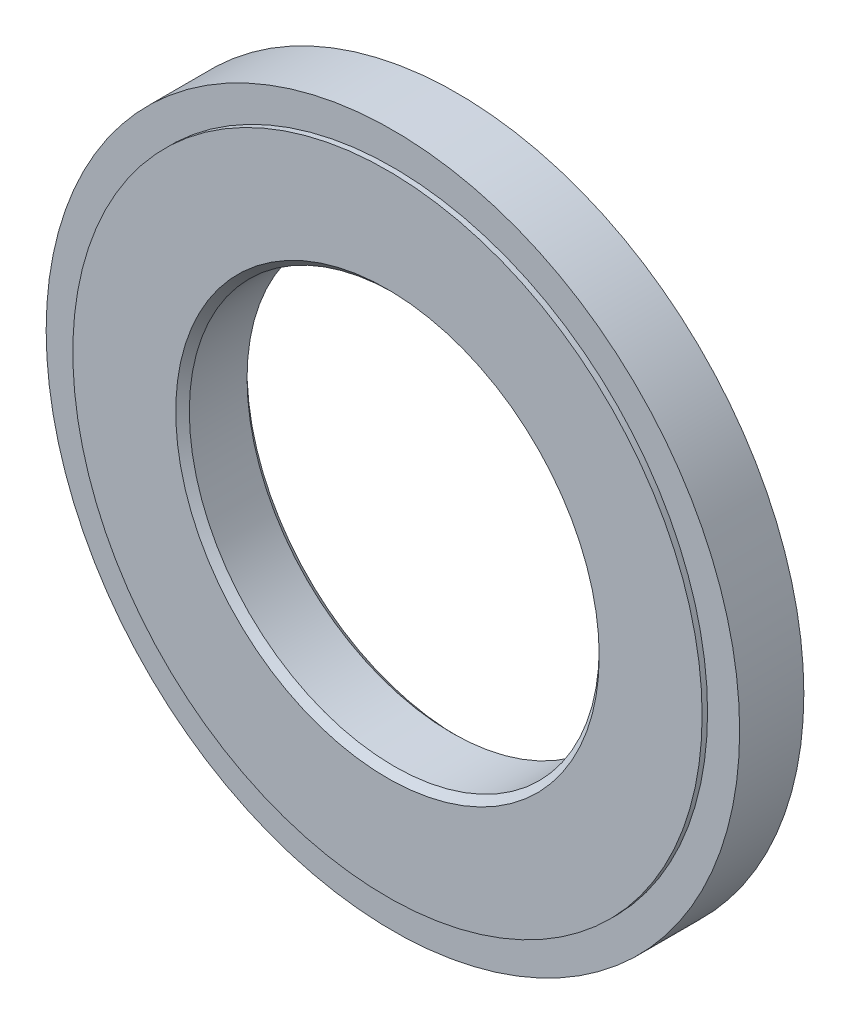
ISO-10303-21;
HEADER;
FILE_DESCRIPTION(('STEP AP214'),'2;1');
FILE_NAME('part.step','',(''),(''),'','','');
FILE_SCHEMA(('AUTOMOTIVE_DESIGN { 1 0 10303 214 1 1 1 1 }'));
ENDSEC;
DATA;
#1=APPLICATION_CONTEXT('core data for automotive mechanical design processes');
#2=APPLICATION_PROTOCOL_DEFINITION('international standard','automotive_design',2000,#1);
#3=PRODUCT_CONTEXT('',#1,'mechanical');
#4=PRODUCT('Part','Part','',(#3));
#5=PRODUCT_RELATED_PRODUCT_CATEGORY('part','',(#4));
#6=PRODUCT_DEFINITION_FORMATION('','',#4);
#7=PRODUCT_DEFINITION_CONTEXT('part definition',#1,'design');
#8=PRODUCT_DEFINITION('design','',#6,#7);
#9=PRODUCT_DEFINITION_SHAPE('','',#8);
#10=(LENGTH_UNIT() NAMED_UNIT(*) SI_UNIT(.MILLI.,.METRE.));
#11=(NAMED_UNIT(*) PLANE_ANGLE_UNIT() SI_UNIT($,.RADIAN.));
#12=(NAMED_UNIT(*) SI_UNIT($,.STERADIAN.) SOLID_ANGLE_UNIT());
#13=UNCERTAINTY_MEASURE_WITH_UNIT(LENGTH_MEASURE(1.E-05),#10,'distance_accuracy_value','');
#14=(GEOMETRIC_REPRESENTATION_CONTEXT(3) GLOBAL_UNCERTAINTY_ASSIGNED_CONTEXT((#13)) GLOBAL_UNIT_ASSIGNED_CONTEXT((#10,
#11,#12)) REPRESENTATION_CONTEXT('',''));
#15=CARTESIAN_POINT('',(0.,0.,0.));
#16=DIRECTION('',(0.,0.,1.));
#17=DIRECTION('',(1.,0.,0.));
#18=AXIS2_PLACEMENT_3D('',#15,#16,#17);
#19=CARTESIAN_POINT('',(0.,0.,10.5));
#20=DIRECTION('',(0.,0.,-1.));
#21=DIRECTION('',(-1.,0.,0.));
#22=AXIS2_PLACEMENT_3D('',#19,#20,#21);
#23=CYLINDRICAL_SURFACE('',#22,102.1);
#24=CARTESIAN_POINT('',(0.,0.,8.9));
#25=DIRECTION('',(0.,0.,1.));
#26=DIRECTION('',(1.,0.,0.));
#27=AXIS2_PLACEMENT_3D('',#24,#25,#26);
#28=CIRCLE('',#27,102.1);
#29=CARTESIAN_POINT('',(-102.1,0.,8.9));
#30=VERTEX_POINT('',#29);
#31=EDGE_CURVE('E112',#30,#30,#28,.T.);
#32=CARTESIAN_POINT('',(0.,0.,-10.));
#33=DIRECTION('',(0.,0.,-1.));
#34=DIRECTION('',(-1.,0.,0.));
#35=AXIS2_PLACEMENT_3D('',#32,#33,#34);
#36=CIRCLE('',#35,102.1);
#37=CARTESIAN_POINT('',(-102.1,0.,-10.));
#38=VERTEX_POINT('',#37);
#39=EDGE_CURVE('E103',#38,#38,#36,.F.);
#40=CARTESIAN_POINT('',(-102.1,0.,8.9));
#41=CARTESIAN_POINT('',(-102.1,0.,8.703125));
#42=CARTESIAN_POINT('',(-102.1,0.,8.50625));
#43=CARTESIAN_POINT('',(-102.1,0.,8.1125));
#44=CARTESIAN_POINT('',(-102.1,0.,7.915625));
#45=CARTESIAN_POINT('',(-102.1,0.,7.521875));
#46=CARTESIAN_POINT('',(-102.1,0.,7.325));
#47=CARTESIAN_POINT('',(-102.1,0.,6.93125));
#48=CARTESIAN_POINT('',(-102.1,0.,6.734375));
#49=CARTESIAN_POINT('',(-102.1,0.,6.340625));
#50=CARTESIAN_POINT('',(-102.1,0.,6.14375));
#51=CARTESIAN_POINT('',(-102.1,0.,5.75));
#52=CARTESIAN_POINT('',(-102.1,0.,5.553125));
#53=CARTESIAN_POINT('',(-102.1,0.,5.159375));
#54=CARTESIAN_POINT('',(-102.1,0.,4.9625));
#55=CARTESIAN_POINT('',(-102.1,0.,4.56875));
#56=CARTESIAN_POINT('',(-102.1,0.,4.371875));
#57=CARTESIAN_POINT('',(-102.1,0.,3.978125));
#58=CARTESIAN_POINT('',(-102.1,0.,3.78125));
#59=CARTESIAN_POINT('',(-102.1,0.,3.3875));
#60=CARTESIAN_POINT('',(-102.1,0.,3.190625));
#61=CARTESIAN_POINT('',(-102.1,0.,2.796875));
#62=CARTESIAN_POINT('',(-102.1,0.,2.6));
#63=CARTESIAN_POINT('',(-102.1,0.,2.20625));
#64=CARTESIAN_POINT('',(-102.1,0.,2.009375));
#65=CARTESIAN_POINT('',(-102.1,0.,1.615625));
#66=CARTESIAN_POINT('',(-102.1,0.,1.41875));
#67=CARTESIAN_POINT('',(-102.1,0.,1.025));
#68=CARTESIAN_POINT('',(-102.1,0.,0.828125));
#69=CARTESIAN_POINT('',(-102.1,0.,0.434375));
#70=CARTESIAN_POINT('',(-102.1,0.,0.237499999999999));
#71=CARTESIAN_POINT('',(-102.1,0.,-0.156250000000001));
#72=CARTESIAN_POINT('',(-102.1,0.,-0.353125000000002));
#73=CARTESIAN_POINT('',(-102.1,0.,-0.746875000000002));
#74=CARTESIAN_POINT('',(-102.1,0.,-0.943750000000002));
#75=CARTESIAN_POINT('',(-102.1,0.,-1.3375));
#76=CARTESIAN_POINT('',(-102.1,0.,-1.534375));
#77=CARTESIAN_POINT('',(-102.1,0.,-1.928125));
#78=CARTESIAN_POINT('',(-102.1,0.,-2.125));
#79=CARTESIAN_POINT('',(-102.1,0.,-2.51875));
#80=CARTESIAN_POINT('',(-102.1,0.,-2.715625));
#81=CARTESIAN_POINT('',(-102.1,0.,-3.109375));
#82=CARTESIAN_POINT('',(-102.1,0.,-3.30625));
#83=CARTESIAN_POINT('',(-102.1,0.,-3.7));
#84=CARTESIAN_POINT('',(-102.1,0.,-3.896875));
#85=CARTESIAN_POINT('',(-102.1,0.,-4.290625));
#86=CARTESIAN_POINT('',(-102.1,0.,-4.4875));
#87=CARTESIAN_POINT('',(-102.1,0.,-4.88125));
#88=CARTESIAN_POINT('',(-102.1,0.,-5.078125));
#89=CARTESIAN_POINT('',(-102.1,0.,-5.471875));
#90=CARTESIAN_POINT('',(-102.1,0.,-5.66875));
#91=CARTESIAN_POINT('',(-102.1,0.,-6.0625));
#92=CARTESIAN_POINT('',(-102.1,0.,-6.259375));
#93=CARTESIAN_POINT('',(-102.1,0.,-6.653125));
#94=CARTESIAN_POINT('',(-102.1,0.,-6.85));
#95=CARTESIAN_POINT('',(-102.1,0.,-7.24375));
#96=CARTESIAN_POINT('',(-102.1,0.,-7.440625));
#97=CARTESIAN_POINT('',(-102.1,0.,-7.834375));
#98=CARTESIAN_POINT('',(-102.1,0.,-8.03125));
#99=CARTESIAN_POINT('',(-102.1,0.,-8.425));
#100=CARTESIAN_POINT('',(-102.1,0.,-8.621875));
#101=CARTESIAN_POINT('',(-102.1,0.,-9.015625));
#102=CARTESIAN_POINT('',(-102.1,0.,-9.2125));
#103=CARTESIAN_POINT('',(-102.1,0.,-9.60625));
#104=CARTESIAN_POINT('',(-102.1,0.,-9.803125));
#105=CARTESIAN_POINT('',(-102.1,0.,-10.));
#106=B_SPLINE_CURVE_WITH_KNOTS('',3,(#40,#41,#42,#43,#44,#45,#46,#47,#48,#49,#50,#51,#52,#53,
#54,#55,#56,#57,#58,#59,#60,#61,#62,#63,#64,#65,#66,#67,#68,#69,#70,#71,#72,#73,#74,#75,#76,#77,
#78,#79,#80,#81,#82,#83,#84,#85,#86,#87,#88,#89,#90,#91,#92,#93,#94,#95,#96,#97,#98,#99,#100,
#101,#102,#103,#104,#105),.UNSPECIFIED.,.F.,.F.,(4,2,2,2,2,2,2,2,2,2,2,2,2,2,2,2,2,2,2,2,2,2,2,
2,2,2,2,2,2,2,2,2,4),(0.,0.590625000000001,1.18125,1.771875,2.3625,2.953125,3.54375,4.134375,
4.725,5.315625,5.90625,6.496875,7.0875,7.678125,8.26875,8.859375,9.45,10.040625,10.63125,
11.221875,11.8125,12.403125,12.99375,13.584375,14.175,14.765625,15.35625,15.946875,16.5375,
17.128125,17.71875,18.309375,18.9),.UNSPECIFIED.);
#107=EDGE_CURVE('BSEAM33',#30,#38,#106,.T.);
#108=ORIENTED_EDGE('',*,*,#31,.F.);
#109=ORIENTED_EDGE('',*,*,#39,.T.);
#110=ORIENTED_EDGE('',*,*,#107,.T.);
#111=ORIENTED_EDGE('',*,*,#107,.F.);
#112=EDGE_LOOP('',(#108,#110,#109,#111));
#113=FACE_BOUND('',#112,.T.);
#114=ADVANCED_FACE('F33',(#113),#23,.T.);
#115=CARTESIAN_POINT('',(0.,0.,8.9));
#116=DIRECTION('',(0.,0.,1.));
#117=DIRECTION('',(1.,0.,0.));
#118=AXIS2_PLACEMENT_3D('',#115,#116,#117);
#119=CYLINDRICAL_SURFACE('',#118,92.65);
#120=CARTESIAN_POINT('',(0.,0.,8.9));
#121=DIRECTION('',(0.,0.,1.));
#122=DIRECTION('',(1.,0.,0.));
#123=AXIS2_PLACEMENT_3D('',#120,#121,#122);
#124=CIRCLE('',#123,92.65);
#125=CARTESIAN_POINT('',(92.65,0.,8.9));
#126=VERTEX_POINT('',#125);
#127=EDGE_CURVE('E109',#126,#126,#124,.T.);
#128=ORIENTED_EDGE('',*,*,#127,.T.);
#129=EDGE_LOOP('',(#128));
#130=FACE_BOUND('',#129,.T.);
#131=CARTESIAN_POINT('',(0.,0.,10.5));
#132=DIRECTION('',(0.,0.,1.));
#133=DIRECTION('',(1.,0.,0.));
#134=AXIS2_PLACEMENT_3D('',#131,#132,#133);
#135=CIRCLE('',#134,92.65);
#136=CARTESIAN_POINT('',(92.65,0.,10.5));
#137=VERTEX_POINT('',#136);
#138=EDGE_CURVE('E106',#137,#137,#135,.T.);
#139=ORIENTED_EDGE('',*,*,#138,.F.);
#140=EDGE_LOOP('',(#139));
#141=FACE_BOUND('',#140,.T.);
#142=ADVANCED_FACE('F156',(#130,#141),#119,.T.);
#143=CARTESIAN_POINT('',(0.,-224.761421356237,8.9));
#144=DIRECTION('',(0.,0.,1.));
#145=DIRECTION('',(1.,0.,0.));
#146=AXIS2_PLACEMENT_3D('',#143,#144,#145);
#147=PLANE('',#146);
#148=ORIENTED_EDGE('',*,*,#127,.F.);
#149=EDGE_LOOP('',(#148));
#150=FACE_BOUND('',#149,.T.);
#151=ORIENTED_EDGE('',*,*,#31,.T.);
#152=EDGE_LOOP('',(#151));
#153=FACE_BOUND('',#152,.T.);
#154=ADVANCED_FACE('F152',(#150,#153),#147,.T.);
#155=CARTESIAN_POINT('',(0.,0.,10.5));
#156=DIRECTION('',(0.,0.,1.));
#157=DIRECTION('',(1.,0.,0.));
#158=AXIS2_PLACEMENT_3D('',#155,#156,#157);
#159=PLANE('',#158);
#160=CARTESIAN_POINT('',(0.,0.,10.5));
#161=DIRECTION('',(0.,0.,1.));
#162=DIRECTION('',(1.,0.,0.));
#163=AXIS2_PLACEMENT_3D('',#160,#161,#162);
#164=CIRCLE('',#163,62.3500000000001);
#165=CARTESIAN_POINT('',(62.3500000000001,0.,10.5));
#166=VERTEX_POINT('',#165);
#167=EDGE_CURVE('E11',#166,#166,#164,.F.);
#168=ORIENTED_EDGE('',*,*,#167,.T.);
#169=EDGE_LOOP('',(#168));
#170=FACE_BOUND('',#169,.T.);
#171=ORIENTED_EDGE('',*,*,#138,.T.);
#172=EDGE_LOOP('',(#171));
#173=FACE_BOUND('',#172,.T.);
#174=ADVANCED_FACE('F143',(#170,#173),#159,.T.);
#175=CARTESIAN_POINT('',(0.,0.,-10.));
#176=DIRECTION('',(0.,0.,-1.));
#177=DIRECTION('',(-1.,0.,0.));
#178=AXIS2_PLACEMENT_3D('',#175,#176,#177);
#179=CYLINDRICAL_SURFACE('',#178,92.65);
#180=CARTESIAN_POINT('',(0.,0.,-10.));
#181=DIRECTION('',(0.,0.,-1.));
#182=DIRECTION('',(-1.,0.,0.));
#183=AXIS2_PLACEMENT_3D('',#180,#181,#182);
#184=CIRCLE('',#183,92.65);
#185=CARTESIAN_POINT('',(-92.65,0.,-10.));
#186=VERTEX_POINT('',#185);
#187=EDGE_CURVE('E100',#186,#186,#184,.T.);
#188=ORIENTED_EDGE('',*,*,#187,.T.);
#189=EDGE_LOOP('',(#188));
#190=FACE_BOUND('',#189,.T.);
#191=CARTESIAN_POINT('',(0.,0.,-10.5));
#192=DIRECTION('',(0.,0.,-1.));
#193=DIRECTION('',(-1.,0.,0.));
#194=AXIS2_PLACEMENT_3D('',#191,#192,#193);
#195=CIRCLE('',#194,92.65);
#196=CARTESIAN_POINT('',(-92.65,0.,-10.5));
#197=VERTEX_POINT('',#196);
#198=EDGE_CURVE('E97',#197,#197,#195,.T.);
#199=ORIENTED_EDGE('',*,*,#198,.F.);
#200=EDGE_LOOP('',(#199));
#201=FACE_BOUND('',#200,.T.);
#202=ADVANCED_FACE('F141',(#190,#201),#179,.T.);
#203=CARTESIAN_POINT('',(-224.761421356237,0.,-10.));
#204=DIRECTION('',(0.,0.,-1.));
#205=DIRECTION('',(-1.,0.,0.));
#206=AXIS2_PLACEMENT_3D('',#203,#204,#205);
#207=PLANE('',#206);
#208=ORIENTED_EDGE('',*,*,#187,.F.);
#209=EDGE_LOOP('',(#208));
#210=FACE_BOUND('',#209,.T.);
#211=ORIENTED_EDGE('',*,*,#39,.F.);
#212=EDGE_LOOP('',(#211));
#213=FACE_BOUND('',#212,.T.);
#214=ADVANCED_FACE('F136',(#210,#213),#207,.T.);
#215=CARTESIAN_POINT('',(0.,0.,-10.5));
#216=DIRECTION('',(0.,0.,1.));
#217=DIRECTION('',(1.,0.,0.));
#218=AXIS2_PLACEMENT_3D('',#215,#216,#217);
#219=PLANE('',#218);
#220=CARTESIAN_POINT('',(53.88153673,53.88153673,-10.5));
#221=DIRECTION('',(0.,0.,-1.));
#222=DIRECTION('',(-1.,0.,0.));
#223=AXIS2_PLACEMENT_3D('',#220,#221,#222);
#224=CIRCLE('',#223,2.5);
#225=CARTESIAN_POINT('',(51.38153673,53.88153673,-10.5));
#226=VERTEX_POINT('',#225);
#227=EDGE_CURVE('E62',#226,#226,#224,.T.);
#228=ORIENTED_EDGE('',*,*,#227,.F.);
#229=EDGE_LOOP('',(#228));
#230=FACE_BOUND('',#229,.T.);
#231=CARTESIAN_POINT('',(-53.88153673,53.88153673,-10.5));
#232=DIRECTION('',(0.,0.,-1.));
#233=DIRECTION('',(-1.,0.,0.));
#234=AXIS2_PLACEMENT_3D('',#231,#232,#233);
#235=CIRCLE('',#234,2.5);
#236=CARTESIAN_POINT('',(-56.38153673,53.88153673,-10.5));
#237=VERTEX_POINT('',#236);
#238=EDGE_CURVE('E70',#237,#237,#235,.T.);
#239=ORIENTED_EDGE('',*,*,#238,.F.);
#240=EDGE_LOOP('',(#239));
#241=FACE_BOUND('',#240,.T.);
#242=CARTESIAN_POINT('',(-53.88153673,-53.88153673,-10.5));
#243=DIRECTION('',(0.,0.,-1.));
#244=DIRECTION('',(-1.,0.,0.));
#245=AXIS2_PLACEMENT_3D('',#242,#243,#244);
#246=CIRCLE('',#245,2.5);
#247=CARTESIAN_POINT('',(-56.38153673,-53.88153673,-10.5));
#248=VERTEX_POINT('',#247);
#249=EDGE_CURVE('E76',#248,#248,#246,.T.);
#250=ORIENTED_EDGE('',*,*,#249,.F.);
#251=EDGE_LOOP('',(#250));
#252=FACE_BOUND('',#251,.T.);
#253=CARTESIAN_POINT('',(53.88153673,-53.88153673,-10.5));
#254=DIRECTION('',(0.,0.,-1.));
#255=DIRECTION('',(-1.,0.,0.));
#256=AXIS2_PLACEMENT_3D('',#253,#254,#255);
#257=CIRCLE('',#256,2.5);
#258=CARTESIAN_POINT('',(51.38153673,-53.88153673,-10.5));
#259=VERTEX_POINT('',#258);
#260=EDGE_CURVE('E82',#259,#259,#257,.T.);
#261=ORIENTED_EDGE('',*,*,#260,.F.);
#262=EDGE_LOOP('',(#261));
#263=FACE_BOUND('',#262,.T.);
#264=CARTESIAN_POINT('',(0.,76.2,-10.5));
#265=DIRECTION('',(0.,0.,-1.));
#266=DIRECTION('',(-1.,0.,0.));
#267=AXIS2_PLACEMENT_3D('',#264,#265,#266);
#268=CIRCLE('',#267,1.6);
#269=CARTESIAN_POINT('',(-1.6,76.2,-10.5));
#270=VERTEX_POINT('',#269);
#271=EDGE_CURVE('E88',#270,#270,#268,.T.);
#272=ORIENTED_EDGE('',*,*,#271,.F.);
#273=EDGE_LOOP('',(#272));
#274=FACE_BOUND('',#273,.T.);
#275=CARTESIAN_POINT('',(0.,-76.2,-10.5));
#276=DIRECTION('',(0.,0.,-1.));
#277=DIRECTION('',(-1.,0.,0.));
#278=AXIS2_PLACEMENT_3D('',#275,#276,#277);
#279=CIRCLE('',#278,1.6);
#280=CARTESIAN_POINT('',(-1.6,-76.2,-10.5));
#281=VERTEX_POINT('',#280);
#282=EDGE_CURVE('E94',#281,#281,#279,.T.);
#283=ORIENTED_EDGE('',*,*,#282,.F.);
#284=EDGE_LOOP('',(#283));
#285=FACE_BOUND('',#284,.T.);
#286=CARTESIAN_POINT('',(0.,0.,-10.5));
#287=DIRECTION('',(0.,0.,1.));
#288=DIRECTION('',(1.,0.,0.));
#289=AXIS2_PLACEMENT_3D('',#286,#287,#288);
#290=CIRCLE('',#289,62.3499999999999);
#291=CARTESIAN_POINT('',(62.3499999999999,0.,-10.5));
#292=VERTEX_POINT('',#291);
#293=EDGE_CURVE('E115',#292,#292,#290,.T.);
#294=ORIENTED_EDGE('',*,*,#293,.T.);
#295=EDGE_LOOP('',(#294));
#296=FACE_BOUND('',#295,.T.);
#297=ORIENTED_EDGE('',*,*,#198,.T.);
#298=EDGE_LOOP('',(#297));
#299=FACE_BOUND('',#298,.T.);
#300=ADVANCED_FACE('F133',(#230,#241,#252,#263,#274,#285,#296,#299),#219,.F.);
#301=CARTESIAN_POINT('',(0.,0.,-10.5));
#302=DIRECTION('',(0.,0.,1.));
#303=DIRECTION('',(1.,0.,0.));
#304=AXIS2_PLACEMENT_3D('',#301,#302,#303);
#305=CYLINDRICAL_SURFACE('',#304,60.35);
#306=CARTESIAN_POINT('',(0.,0.,-8.50000000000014));
#307=DIRECTION('',(0.,0.,1.));
#308=DIRECTION('',(1.,0.,0.));
#309=AXIS2_PLACEMENT_3D('',#306,#307,#308);
#310=CIRCLE('',#309,60.35);
#311=CARTESIAN_POINT('',(60.35,0.,-8.50000000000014));
#312=VERTEX_POINT('',#311);
#313=EDGE_CURVE('E40',#312,#312,#310,.F.);
#314=CARTESIAN_POINT('',(0.,0.,8.49999999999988));
#315=DIRECTION('',(0.,0.,1.));
#316=DIRECTION('',(1.,0.,0.));
#317=AXIS2_PLACEMENT_3D('',#314,#315,#316);
#318=CIRCLE('',#317,60.35);
#319=CARTESIAN_POINT('',(60.35,0.,8.49999999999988));
#320=VERTEX_POINT('',#319);
#321=EDGE_CURVE('E118',#320,#320,#318,.T.);
#322=CARTESIAN_POINT('',(60.35,0.,-8.50000000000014));
#323=CARTESIAN_POINT('',(60.35,0.,-8.3229166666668));
#324=CARTESIAN_POINT('',(60.35,0.,-8.14583333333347));
#325=CARTESIAN_POINT('',(60.35,0.,-7.7916666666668));
#326=CARTESIAN_POINT('',(60.35,0.,-7.61458333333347));
#327=CARTESIAN_POINT('',(60.35,0.,-7.2604166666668));
#328=CARTESIAN_POINT('',(60.35,0.,-7.08333333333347));
#329=CARTESIAN_POINT('',(60.35,0.,-6.7291666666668));
#330=CARTESIAN_POINT('',(60.35,0.,-6.55208333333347));
#331=CARTESIAN_POINT('',(60.35,0.,-6.1979166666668));
#332=CARTESIAN_POINT('',(60.35,0.,-6.02083333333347));
#333=CARTESIAN_POINT('',(60.35,0.,-5.6666666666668));
#334=CARTESIAN_POINT('',(60.35,0.,-5.48958333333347));
#335=CARTESIAN_POINT('',(60.35,0.,-5.1354166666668));
#336=CARTESIAN_POINT('',(60.35,0.,-4.95833333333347));
#337=CARTESIAN_POINT('',(60.35,0.,-4.6041666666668));
#338=CARTESIAN_POINT('',(60.35,0.,-4.42708333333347));
#339=CARTESIAN_POINT('',(60.35,0.,-4.0729166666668));
#340=CARTESIAN_POINT('',(60.35,0.,-3.89583333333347));
#341=CARTESIAN_POINT('',(60.35,0.,-3.5416666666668));
#342=CARTESIAN_POINT('',(60.35,0.,-3.36458333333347));
#343=CARTESIAN_POINT('',(60.35,0.,-3.0104166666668));
#344=CARTESIAN_POINT('',(60.35,0.,-2.83333333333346));
#345=CARTESIAN_POINT('',(60.35,0.,-2.4791666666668));
#346=CARTESIAN_POINT('',(60.35,0.,-2.30208333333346));
#347=CARTESIAN_POINT('',(60.35,0.,-1.9479166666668));
#348=CARTESIAN_POINT('',(60.35,0.,-1.77083333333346));
#349=CARTESIAN_POINT('',(60.35,0.,-1.4166666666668));
#350=CARTESIAN_POINT('',(60.35,0.,-1.23958333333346));
#351=CARTESIAN_POINT('',(60.35,0.,-0.885416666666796));
#352=CARTESIAN_POINT('',(60.35,0.,-0.708333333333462));
#353=CARTESIAN_POINT('',(60.35,0.,-0.354166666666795));
#354=CARTESIAN_POINT('',(60.35,0.,-0.177083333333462));
#355=CARTESIAN_POINT('',(60.35,0.,0.177083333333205));
#356=CARTESIAN_POINT('',(60.35,0.,0.354166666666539));
#357=CARTESIAN_POINT('',(60.35,0.,0.708333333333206));
#358=CARTESIAN_POINT('',(60.35,0.,0.885416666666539));
#359=CARTESIAN_POINT('',(60.35,0.,1.23958333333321));
#360=CARTESIAN_POINT('',(60.35,0.,1.41666666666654));
#361=CARTESIAN_POINT('',(60.35,0.,1.77083333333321));
#362=CARTESIAN_POINT('',(60.35,0.,1.94791666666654));
#363=CARTESIAN_POINT('',(60.35,0.,2.30208333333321));
#364=CARTESIAN_POINT('',(60.35,0.,2.47916666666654));
#365=CARTESIAN_POINT('',(60.35,0.,2.83333333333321));
#366=CARTESIAN_POINT('',(60.35,0.,3.01041666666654));
#367=CARTESIAN_POINT('',(60.35,0.,3.36458333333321));
#368=CARTESIAN_POINT('',(60.35,0.,3.54166666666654));
#369=CARTESIAN_POINT('',(60.35,0.,3.89583333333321));
#370=CARTESIAN_POINT('',(60.35,0.,4.07291666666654));
#371=CARTESIAN_POINT('',(60.35,0.,4.42708333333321));
#372=CARTESIAN_POINT('',(60.35,0.,4.60416666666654));
#373=CARTESIAN_POINT('',(60.35,0.,4.95833333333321));
#374=CARTESIAN_POINT('',(60.35,0.,5.13541666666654));
#375=CARTESIAN_POINT('',(60.35,0.,5.48958333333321));
#376=CARTESIAN_POINT('',(60.35,0.,5.66666666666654));
#377=CARTESIAN_POINT('',(60.35,0.,6.02083333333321));
#378=CARTESIAN_POINT('',(60.35,0.,6.19791666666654));
#379=CARTESIAN_POINT('',(60.35,0.,6.55208333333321));
#380=CARTESIAN_POINT('',(60.35,0.,6.72916666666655));
#381=CARTESIAN_POINT('',(60.35,0.,7.08333333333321));
#382=CARTESIAN_POINT('',(60.35,0.,7.26041666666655));
#383=CARTESIAN_POINT('',(60.35,0.,7.61458333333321));
#384=CARTESIAN_POINT('',(60.35,0.,7.79166666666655));
#385=CARTESIAN_POINT('',(60.35,0.,8.14583333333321));
#386=CARTESIAN_POINT('',(60.35,0.,8.32291666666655));
#387=CARTESIAN_POINT('',(60.35,0.,8.49999999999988));
#388=B_SPLINE_CURVE_WITH_KNOTS('',3,(#322,#323,#324,#325,#326,#327,#328,#329,#330,#331,#332,
#333,#334,#335,#336,#337,#338,#339,#340,#341,#342,#343,#344,#345,#346,#347,#348,#349,#350,#351,
#352,#353,#354,#355,#356,#357,#358,#359,#360,#361,#362,#363,#364,#365,#366,#367,#368,#369,#370,
#371,#372,#373,#374,#375,#376,#377,#378,#379,#380,#381,#382,#383,#384,#385,#386,#387),
.UNSPECIFIED.,.F.,.F.,(4,2,2,2,2,2,2,2,2,2,2,2,2,2,2,2,2,2,2,2,2,2,2,2,2,2,2,2,2,2,2,2,4),(0.,
0.53125,1.0625,1.59375,2.125,2.65625,3.1875,3.71875,4.25,4.78125000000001,5.31250000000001,
5.84375000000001,6.37500000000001,6.90625000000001,7.43750000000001,7.96875000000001,
8.50000000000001,9.03125000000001,9.56250000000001,10.09375,10.625,11.15625,11.6875,12.21875,
12.75,13.28125,13.8125,14.34375,14.875,15.40625,15.9375,16.46875,17.),.UNSPECIFIED.);
#389=EDGE_CURVE('BSEAM123',#312,#320,#388,.T.);
#390=ORIENTED_EDGE('',*,*,#313,.T.);
#391=ORIENTED_EDGE('',*,*,#321,.T.);
#392=ORIENTED_EDGE('',*,*,#389,.T.);
#393=ORIENTED_EDGE('',*,*,#389,.F.);
#394=EDGE_LOOP('',(#390,#392,#391,#393));
#395=FACE_BOUND('',#394,.T.);
#396=ADVANCED_FACE('F123',(#395),#305,.F.);
#397=CARTESIAN_POINT('',(0.,0.,-10.5));
#398=DIRECTION('',(0.,0.,-1.));
#399=DIRECTION('',(-1.,0.,0.));
#400=AXIS2_PLACEMENT_3D('',#397,#398,#399);
#401=CONICAL_SURFACE('',#400,62.3499999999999,0.785398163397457);
#402=ORIENTED_EDGE('',*,*,#313,.F.);
#403=EDGE_LOOP('',(#402));
#404=FACE_BOUND('',#403,.T.);
#405=ORIENTED_EDGE('',*,*,#293,.F.);
#406=EDGE_LOOP('',(#405));
#407=FACE_BOUND('',#406,.T.);
#408=ADVANCED_FACE('F126',(#404,#407),#401,.F.);
#409=CARTESIAN_POINT('',(0.,0.,8.49999999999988));
#410=DIRECTION('',(0.,0.,1.));
#411=DIRECTION('',(1.,0.,0.));
#412=AXIS2_PLACEMENT_3D('',#409,#410,#411);
#413=CONICAL_SURFACE('',#412,60.35,0.785398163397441);
#414=ORIENTED_EDGE('',*,*,#167,.F.);
#415=EDGE_LOOP('',(#414));
#416=FACE_BOUND('',#415,.T.);
#417=ORIENTED_EDGE('',*,*,#321,.F.);
#418=EDGE_LOOP('',(#417));
#419=FACE_BOUND('',#418,.T.);
#420=ADVANCED_FACE('F129',(#416,#419),#413,.F.);
#421=CARTESIAN_POINT('',(0.,-76.2,-10.5));
#422=DIRECTION('',(0.,0.,-1.));
#423=DIRECTION('',(-1.,0.,0.));
#424=AXIS2_PLACEMENT_3D('',#421,#422,#423);
#425=CYLINDRICAL_SURFACE('',#424,1.6);
#426=CARTESIAN_POINT('',(0.,-76.2,-5.7));
#427=DIRECTION('',(0.,0.,-1.));
#428=DIRECTION('',(-1.,0.,0.));
#429=AXIS2_PLACEMENT_3D('',#426,#427,#428);
#430=CIRCLE('',#429,1.6);
#431=CARTESIAN_POINT('',(-1.6,-76.2,-5.7));
#432=VERTEX_POINT('',#431);
#433=EDGE_CURVE('E91',#432,#432,#430,.T.);
#434=ORIENTED_EDGE('',*,*,#433,.F.);
#435=EDGE_LOOP('',(#434));
#436=FACE_BOUND('',#435,.T.);
#437=ORIENTED_EDGE('',*,*,#282,.T.);
#438=EDGE_LOOP('',(#437));
#439=FACE_BOUND('',#438,.T.);
#440=ADVANCED_FACE('F209',(#436,#439),#425,.F.);
#441=CARTESIAN_POINT('',(0.,-76.2,-5.7));
#442=DIRECTION('',(0.,0.,1.));
#443=DIRECTION('',(1.,0.,0.));
#444=AXIS2_PLACEMENT_3D('',#441,#442,#443);
#445=PLANE('',#444);
#446=ORIENTED_EDGE('',*,*,#433,.T.);
#447=EDGE_LOOP('',(#446));
#448=FACE_BOUND('',#447,.T.);
#449=ADVANCED_FACE('F219',(#448),#445,.F.);
#450=CARTESIAN_POINT('',(0.,76.2,-10.5));
#451=DIRECTION('',(0.,0.,-1.));
#452=DIRECTION('',(-1.,0.,0.));
#453=AXIS2_PLACEMENT_3D('',#450,#451,#452);
#454=CYLINDRICAL_SURFACE('',#453,1.6);
#455=CARTESIAN_POINT('',(0.,76.2,-5.7));
#456=DIRECTION('',(0.,0.,-1.));
#457=DIRECTION('',(-1.,0.,0.));
#458=AXIS2_PLACEMENT_3D('',#455,#456,#457);
#459=CIRCLE('',#458,1.6);
#460=CARTESIAN_POINT('',(-1.6,76.2,-5.7));
#461=VERTEX_POINT('',#460);
#462=EDGE_CURVE('E85',#461,#461,#459,.T.);
#463=ORIENTED_EDGE('',*,*,#462,.F.);
#464=EDGE_LOOP('',(#463));
#465=FACE_BOUND('',#464,.T.);
#466=ORIENTED_EDGE('',*,*,#271,.T.);
#467=EDGE_LOOP('',(#466));
#468=FACE_BOUND('',#467,.T.);
#469=ADVANCED_FACE('F229',(#465,#468),#454,.F.);
#470=CARTESIAN_POINT('',(0.,76.2,-5.7));
#471=DIRECTION('',(0.,0.,1.));
#472=DIRECTION('',(1.,0.,0.));
#473=AXIS2_PLACEMENT_3D('',#470,#471,#472);
#474=PLANE('',#473);
#475=ORIENTED_EDGE('',*,*,#462,.T.);
#476=EDGE_LOOP('',(#475));
#477=FACE_BOUND('',#476,.T.);
#478=ADVANCED_FACE('F239',(#477),#474,.F.);
#479=CARTESIAN_POINT('',(53.88153673,-53.88153673,-10.5));
#480=DIRECTION('',(0.,0.,-1.));
#481=DIRECTION('',(-1.,0.,0.));
#482=AXIS2_PLACEMENT_3D('',#479,#480,#481);
#483=CYLINDRICAL_SURFACE('',#482,2.5);
#484=CARTESIAN_POINT('',(53.88153673,-53.88153673,2.2));
#485=DIRECTION('',(0.,0.,-1.));
#486=DIRECTION('',(-1.,0.,0.));
#487=AXIS2_PLACEMENT_3D('',#484,#485,#486);
#488=CIRCLE('',#487,2.5);
#489=CARTESIAN_POINT('',(51.38153673,-53.88153673,2.2));
#490=VERTEX_POINT('',#489);
#491=EDGE_CURVE('E79',#490,#490,#488,.T.);
#492=ORIENTED_EDGE('',*,*,#491,.F.);
#493=EDGE_LOOP('',(#492));
#494=FACE_BOUND('',#493,.T.);
#495=ORIENTED_EDGE('',*,*,#260,.T.);
#496=EDGE_LOOP('',(#495));
#497=FACE_BOUND('',#496,.T.);
#498=ADVANCED_FACE('F249',(#494,#497),#483,.F.);
#499=CARTESIAN_POINT('',(53.88153673,-53.88153673,2.2));
#500=DIRECTION('',(0.,0.,-1.));
#501=DIRECTION('',(-1.,0.,0.));
#502=AXIS2_PLACEMENT_3D('',#499,#500,#501);
#503=CONICAL_SURFACE('',#502,2.5,1.02974425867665);
#504=CARTESIAN_POINT('',(53.88153673,-53.88153673,3.7021515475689));
#505=VERTEX_POINT('',#504);
#506=VERTEX_LOOP('',#505);
#507=FACE_BOUND('',#506,.T.);
#508=ORIENTED_EDGE('',*,*,#491,.T.);
#509=EDGE_LOOP('',(#508));
#510=FACE_BOUND('',#509,.T.);
#511=ADVANCED_FACE('F266',(#507,#510),#503,.F.);
#512=CARTESIAN_POINT('',(-53.88153673,-53.88153673,-10.5));
#513=DIRECTION('',(0.,0.,-1.));
#514=DIRECTION('',(-1.,0.,0.));
#515=AXIS2_PLACEMENT_3D('',#512,#513,#514);
#516=CYLINDRICAL_SURFACE('',#515,2.5);
#517=CARTESIAN_POINT('',(-53.88153673,-53.88153673,2.2));
#518=DIRECTION('',(0.,0.,-1.));
#519=DIRECTION('',(-1.,0.,0.));
#520=AXIS2_PLACEMENT_3D('',#517,#518,#519);
#521=CIRCLE('',#520,2.5);
#522=CARTESIAN_POINT('',(-56.38153673,-53.88153673,2.2));
#523=VERTEX_POINT('',#522);
#524=EDGE_CURVE('E73',#523,#523,#521,.T.);
#525=ORIENTED_EDGE('',*,*,#524,.F.);
#526=EDGE_LOOP('',(#525));
#527=FACE_BOUND('',#526,.T.);
#528=ORIENTED_EDGE('',*,*,#249,.T.);
#529=EDGE_LOOP('',(#528));
#530=FACE_BOUND('',#529,.T.);
#531=ADVANCED_FACE('F276',(#527,#530),#516,.F.);
#532=CARTESIAN_POINT('',(-53.88153673,-53.88153673,2.2));
#533=DIRECTION('',(0.,0.,-1.));
#534=DIRECTION('',(-1.,0.,0.));
#535=AXIS2_PLACEMENT_3D('',#532,#533,#534);
#536=CONICAL_SURFACE('',#535,2.5,1.02974425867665);
#537=CARTESIAN_POINT('',(-53.88153673,-53.88153673,3.7021515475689));
#538=VERTEX_POINT('',#537);
#539=VERTEX_LOOP('',#538);
#540=FACE_BOUND('',#539,.T.);
#541=ORIENTED_EDGE('',*,*,#524,.T.);
#542=EDGE_LOOP('',(#541));
#543=FACE_BOUND('',#542,.T.);
#544=ADVANCED_FACE('F285',(#540,#543),#536,.F.);
#545=CARTESIAN_POINT('',(-53.88153673,53.88153673,-10.5));
#546=DIRECTION('',(0.,0.,-1.));
#547=DIRECTION('',(-1.,0.,0.));
#548=AXIS2_PLACEMENT_3D('',#545,#546,#547);
#549=CYLINDRICAL_SURFACE('',#548,2.5);
#550=CARTESIAN_POINT('',(-53.88153673,53.88153673,2.2));
#551=DIRECTION('',(0.,0.,-1.));
#552=DIRECTION('',(-1.,0.,0.));
#553=AXIS2_PLACEMENT_3D('',#550,#551,#552);
#554=CIRCLE('',#553,2.5);
#555=CARTESIAN_POINT('',(-56.38153673,53.88153673,2.2));
#556=VERTEX_POINT('',#555);
#557=EDGE_CURVE('E65',#556,#556,#554,.T.);
#558=ORIENTED_EDGE('',*,*,#557,.F.);
#559=EDGE_LOOP('',(#558));
#560=FACE_BOUND('',#559,.T.);
#561=ORIENTED_EDGE('',*,*,#238,.T.);
#562=EDGE_LOOP('',(#561));
#563=FACE_BOUND('',#562,.T.);
#564=ADVANCED_FACE('F295',(#560,#563),#549,.F.);
#565=CARTESIAN_POINT('',(-53.88153673,53.88153673,2.2));
#566=DIRECTION('',(0.,0.,-1.));
#567=DIRECTION('',(-1.,0.,0.));
#568=AXIS2_PLACEMENT_3D('',#565,#566,#567);
#569=CONICAL_SURFACE('',#568,2.5,1.02974425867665);
#570=CARTESIAN_POINT('',(-53.88153673,53.88153673,3.7021515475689));
#571=VERTEX_POINT('',#570);
#572=VERTEX_LOOP('',#571);
#573=FACE_BOUND('',#572,.T.);
#574=ORIENTED_EDGE('',*,*,#557,.T.);
#575=EDGE_LOOP('',(#574));
#576=FACE_BOUND('',#575,.T.);
#577=ADVANCED_FACE('F304',(#573,#576),#569,.F.);
#578=CARTESIAN_POINT('',(53.88153673,53.88153673,-10.5));
#579=DIRECTION('',(0.,0.,-1.));
#580=DIRECTION('',(-1.,0.,0.));
#581=AXIS2_PLACEMENT_3D('',#578,#579,#580);
#582=CYLINDRICAL_SURFACE('',#581,2.5);
#583=CARTESIAN_POINT('',(53.88153673,53.88153673,2.2));
#584=DIRECTION('',(0.,0.,-1.));
#585=DIRECTION('',(-1.,0.,0.));
#586=AXIS2_PLACEMENT_3D('',#583,#584,#585);
#587=CIRCLE('',#586,2.5);
#588=CARTESIAN_POINT('',(51.38153673,53.88153673,2.2));
#589=VERTEX_POINT('',#588);
#590=EDGE_CURVE('E60',#589,#589,#587,.T.);
#591=ORIENTED_EDGE('',*,*,#590,.F.);
#592=EDGE_LOOP('',(#591));
#593=FACE_BOUND('',#592,.T.);
#594=ORIENTED_EDGE('',*,*,#227,.T.);
#595=EDGE_LOOP('',(#594));
#596=FACE_BOUND('',#595,.T.);
#597=ADVANCED_FACE('F56',(#593,#596),#582,.F.);
#598=CARTESIAN_POINT('',(53.88153673,53.88153673,2.2));
#599=DIRECTION('',(0.,0.,-1.));
#600=DIRECTION('',(-1.,0.,0.));
#601=AXIS2_PLACEMENT_3D('',#598,#599,#600);
#602=CONICAL_SURFACE('',#601,2.5,1.02974425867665);
#603=CARTESIAN_POINT('',(53.88153673,53.88153673,3.7021515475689));
#604=VERTEX_POINT('',#603);
#605=VERTEX_LOOP('',#604);
#606=FACE_BOUND('',#605,.T.);
#607=ORIENTED_EDGE('',*,*,#590,.T.);
#608=EDGE_LOOP('',(#607));
#609=FACE_BOUND('',#608,.T.);
#610=ADVANCED_FACE('F53',(#606,#609),#602,.F.);
#611=CLOSED_SHELL('',(#114,#142,#154,#174,#202,#214,#300,#396,#408,#420,#440,#449,#469,#478,
#498,#511,#531,#544,#564,#577,#597,#610));
#612=MANIFOLD_SOLID_BREP('B2',#611);
#613=ADVANCED_BREP_SHAPE_REPRESENTATION('',(#18,#612),#14);
#614=SHAPE_DEFINITION_REPRESENTATION(#9,#613);
ENDSEC;
END-ISO-10303-21;
